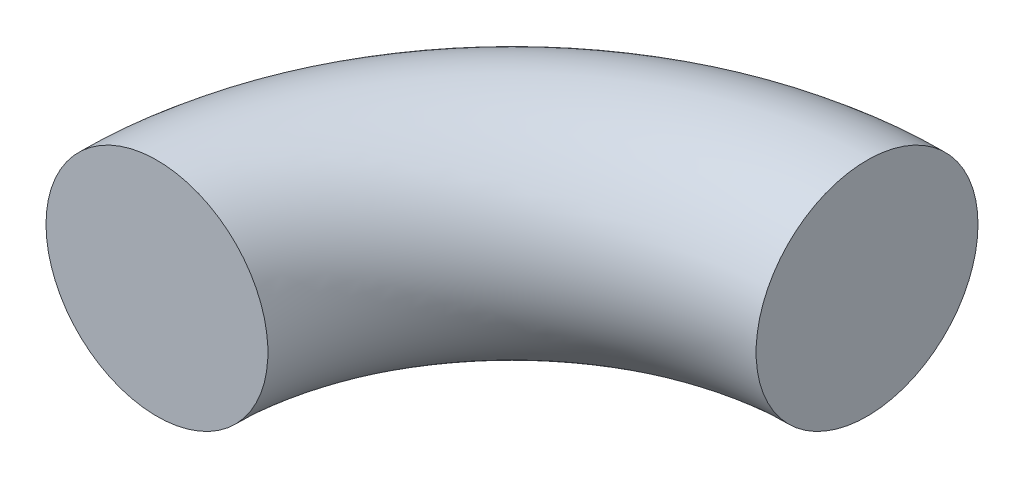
ISO-10303-21;
HEADER;
FILE_DESCRIPTION(('STEP AP214'),'2;1');
FILE_NAME('part.step','',(''),(''),'','','');
FILE_SCHEMA(('AUTOMOTIVE_DESIGN { 1 0 10303 214 1 1 1 1 }'));
ENDSEC;
DATA;
#1=APPLICATION_CONTEXT('core data for automotive mechanical design processes');
#2=APPLICATION_PROTOCOL_DEFINITION('international standard','automotive_design',2000,#1);
#3=PRODUCT_CONTEXT('',#1,'mechanical');
#4=PRODUCT('Part','Part','',(#3));
#5=PRODUCT_RELATED_PRODUCT_CATEGORY('part','',(#4));
#6=PRODUCT_DEFINITION_FORMATION('','',#4);
#7=PRODUCT_DEFINITION_CONTEXT('part definition',#1,'design');
#8=PRODUCT_DEFINITION('design','',#6,#7);
#9=PRODUCT_DEFINITION_SHAPE('','',#8);
#10=(LENGTH_UNIT() NAMED_UNIT(*) SI_UNIT(.MILLI.,.METRE.));
#11=(NAMED_UNIT(*) PLANE_ANGLE_UNIT() SI_UNIT($,.RADIAN.));
#12=(NAMED_UNIT(*) SI_UNIT($,.STERADIAN.) SOLID_ANGLE_UNIT());
#13=UNCERTAINTY_MEASURE_WITH_UNIT(LENGTH_MEASURE(1.E-05),#10,'distance_accuracy_value','');
#14=(GEOMETRIC_REPRESENTATION_CONTEXT(3) GLOBAL_UNCERTAINTY_ASSIGNED_CONTEXT((#13)) GLOBAL_UNIT_ASSIGNED_CONTEXT((#10,
#11,#12)) REPRESENTATION_CONTEXT('',''));
#15=CARTESIAN_POINT('',(0.,0.,0.));
#16=DIRECTION('',(0.,0.,1.));
#17=DIRECTION('',(1.,0.,0.));
#18=AXIS2_PLACEMENT_3D('',#15,#16,#17);
#19=CARTESIAN_POINT('',(-23.5840951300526,12.6398610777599,0.));
#20=DIRECTION('',(0.,1.,0.));
#21=DIRECTION('',(0.,0.,1.));
#22=AXIS2_PLACEMENT_3D('',#19,#20,#21);
#23=TOROIDAL_SURFACE('',#22,2.54,0.793749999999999);
#24=CARTESIAN_POINT('',(-23.5840951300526,12.6398610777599,-2.54));
#25=DIRECTION('',(-1.,0.,0.));
#26=DIRECTION('',(0.,0.,1.));
#27=AXIS2_PLACEMENT_3D('',#24,#25,#26);
#28=CIRCLE('',#27,0.793749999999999);
#29=CARTESIAN_POINT('',(-23.5840951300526,12.6398610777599,-3.33375));
#30=VERTEX_POINT('',#29);
#31=EDGE_CURVE('E10',#30,#30,#28,.T.);
#32=CARTESIAN_POINT('',(-26.1240951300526,12.6398610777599,0.));
#33=DIRECTION('',(0.,0.,1.));
#34=DIRECTION('',(1.,0.,0.));
#35=AXIS2_PLACEMENT_3D('',#32,#33,#34);
#36=CIRCLE('',#35,0.793749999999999);
#37=CARTESIAN_POINT('',(-26.9178451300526,12.6398610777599,0.));
#38=VERTEX_POINT('',#37);
#39=EDGE_CURVE('E35',#38,#38,#36,.T.);
#40=CARTESIAN_POINT('',(-23.5840951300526,12.6398610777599,0.));
#41=DIRECTION('',(0.,1.,0.));
#42=DIRECTION('',(0.,0.,1.));
#43=AXIS2_PLACEMENT_3D('',#40,#41,#42);
#44=CIRCLE('',#43,3.33375);
#45=EDGE_CURVE('',#30,#38,#44,.T.);
#46=ORIENTED_EDGE('',*,*,#31,.T.);
#47=ORIENTED_EDGE('',*,*,#39,.F.);
#48=ORIENTED_EDGE('',*,*,#45,.T.);
#49=ORIENTED_EDGE('',*,*,#45,.F.);
#50=EDGE_LOOP('',(#46,#48,#47,#49));
#51=FACE_BOUND('',#50,.T.);
#52=ADVANCED_FACE('F29',(#51),#23,.T.);
#53=CARTESIAN_POINT('',(-23.5840951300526,12.6398610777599,-2.54));
#54=DIRECTION('',(-1.,0.,0.));
#55=DIRECTION('',(0.,0.,1.));
#56=AXIS2_PLACEMENT_3D('',#53,#54,#55);
#57=PLANE('',#56);
#58=ORIENTED_EDGE('',*,*,#31,.F.);
#59=EDGE_LOOP('',(#58));
#60=FACE_BOUND('',#59,.T.);
#61=ADVANCED_FACE('F44',(#60),#57,.F.);
#62=CARTESIAN_POINT('',(-26.1240951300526,12.6398610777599,0.));
#63=DIRECTION('',(0.,0.,1.));
#64=DIRECTION('',(1.,0.,0.));
#65=AXIS2_PLACEMENT_3D('',#62,#63,#64);
#66=PLANE('',#65);
#67=ORIENTED_EDGE('',*,*,#39,.T.);
#68=EDGE_LOOP('',(#67));
#69=FACE_BOUND('',#68,.T.);
#70=ADVANCED_FACE('F41',(#69),#66,.T.);
#71=CLOSED_SHELL('',(#52,#61,#70));
#72=MANIFOLD_SOLID_BREP('B2',#71);
#73=ADVANCED_BREP_SHAPE_REPRESENTATION('',(#18,#72),#14);
#74=SHAPE_DEFINITION_REPRESENTATION(#9,#73);
ENDSEC;
END-ISO-10303-21;
